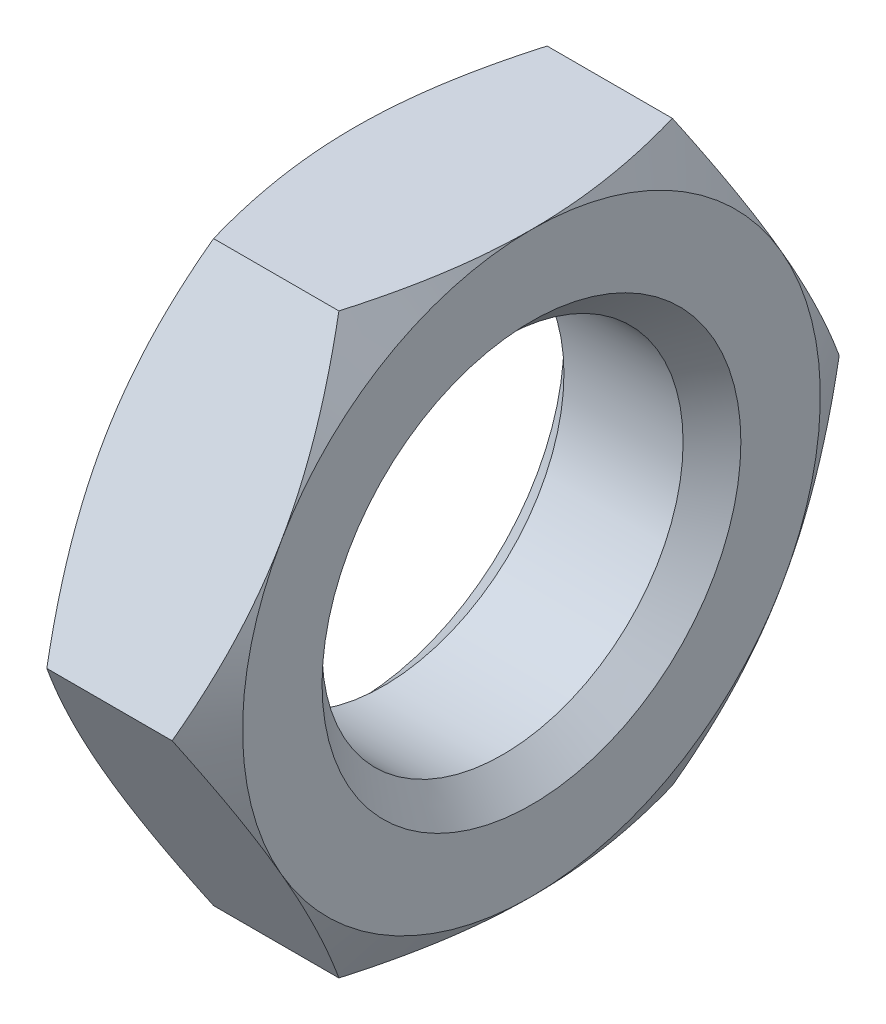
from build123d import *

# Parameters (mm, degrees)
SKETCH1_R      = 2.5
EXTRUDE1_DEPTH = 2.45
CHAMFER1_SIZE  = 0.4


with BuildPart() as part:
    # Sketch1 → Extrude1 (new body)
    with BuildSketch(Plane(origin=(0, 0, 0), x_dir=(0, 0, -1), z_dir=(1, 0, 0))):
        Polygon((2.309401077, 4), (-2.309401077, 4), (-4.618802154, 0), (-2.309401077, -4), (2.309401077, -4), (4.618802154, 0), align=None)
        Circle(SKETCH1_R, mode=Mode.SUBTRACT)
    extrude(amount=EXTRUDE1_DEPTH)

    # Sketch2 → Cut-Revolve1 (revolve, cut)
    with BuildSketch(Plane.XY):
        Polygon((2.45, 4), (2.45, 16), (0, 16), (0, 4), (1.225, 6.121762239), align=None)
    revolve(axis=Axis((2.45, 0, 0), (-1, 0, 0)), mode=Mode.SUBTRACT)

    # Chamfer1
    chamfer1_edges = [part.edges().sort_by_distance(p)[0] for p in [
        (0, 0, 2.5),
        (2.45, 0, 2.5),
    ]]
    chamfer(chamfer1_edges, length=CHAMFER1_SIZE)


solid = part.part
